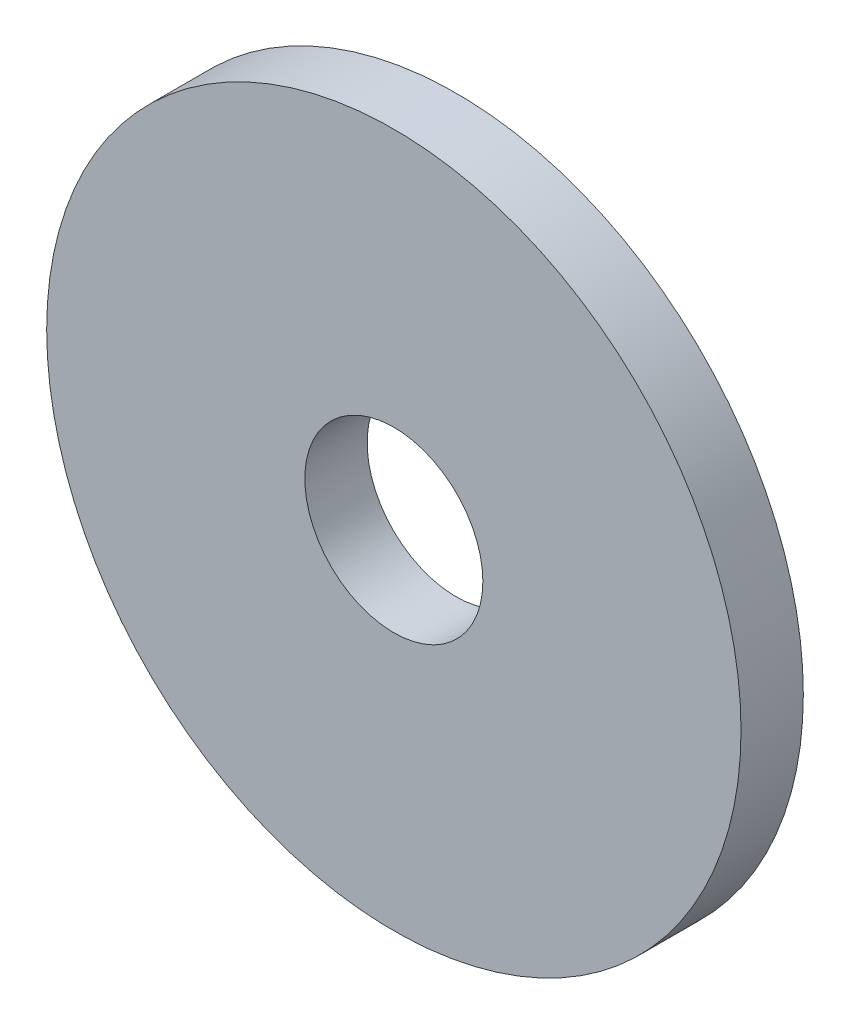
from build123d import *

# Parameters (mm, degrees)
SKETCH1_R   = 3.4671
SKETCH1_R_2 = 0.889
PLATE_DEPTH = 0.6223


with BuildPart() as part:
    # Sketch1 → Plate (new body)
    with BuildSketch(Plane.XY):
        Circle(SKETCH1_R)
        Circle(SKETCH1_R_2, mode=Mode.SUBTRACT)
    extrude(amount=PLATE_DEPTH)


solid = part.part
